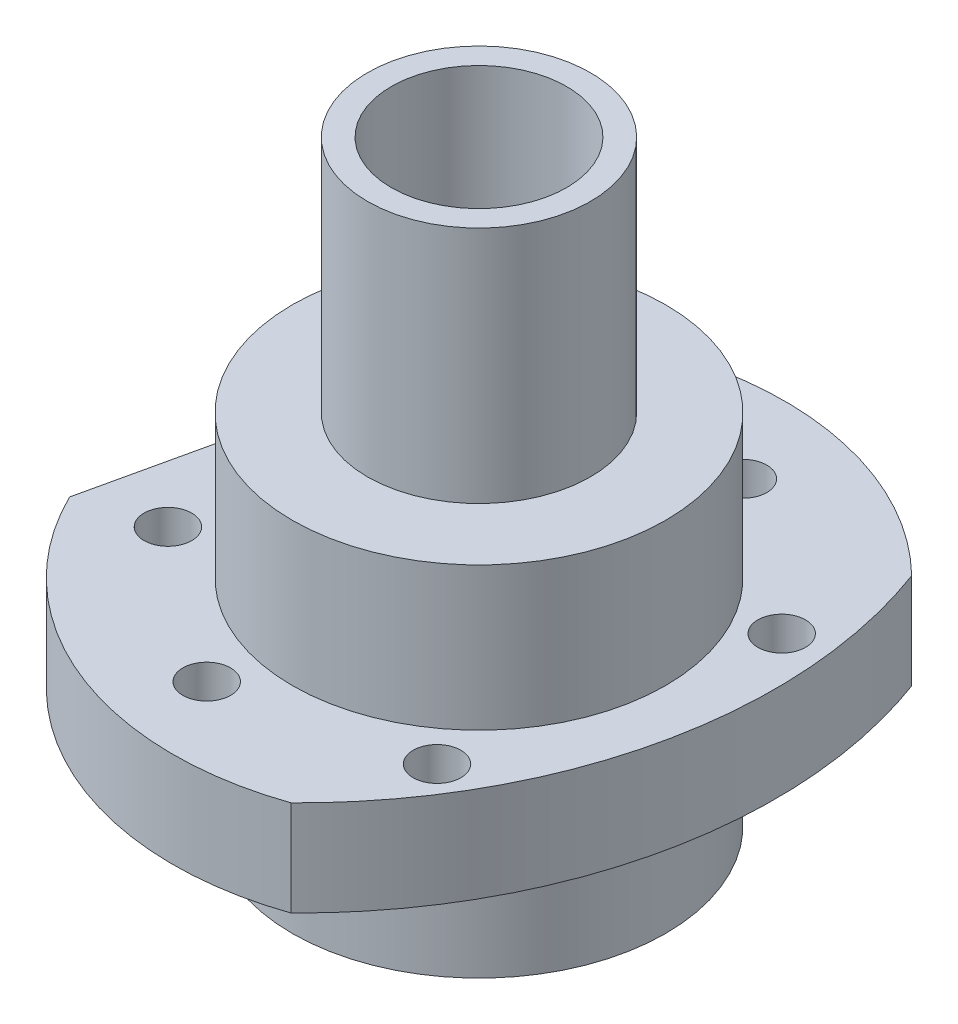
ISO-10303-21;
HEADER;
FILE_DESCRIPTION(('STEP AP214'),'2;1');
FILE_NAME('part.step','',(''),(''),'','','');
FILE_SCHEMA(('AUTOMOTIVE_DESIGN { 1 0 10303 214 1 1 1 1 }'));
ENDSEC;
DATA;
#1=APPLICATION_CONTEXT('core data for automotive mechanical design processes');
#2=APPLICATION_PROTOCOL_DEFINITION('international standard','automotive_design',2000,#1);
#3=PRODUCT_CONTEXT('',#1,'mechanical');
#4=PRODUCT('Part','Part','',(#3));
#5=PRODUCT_RELATED_PRODUCT_CATEGORY('part','',(#4));
#6=PRODUCT_DEFINITION_FORMATION('','',#4);
#7=PRODUCT_DEFINITION_CONTEXT('part definition',#1,'design');
#8=PRODUCT_DEFINITION('design','',#6,#7);
#9=PRODUCT_DEFINITION_SHAPE('','',#8);
#10=(LENGTH_UNIT() NAMED_UNIT(*) SI_UNIT(.MILLI.,.METRE.));
#11=(NAMED_UNIT(*) PLANE_ANGLE_UNIT() SI_UNIT($,.RADIAN.));
#12=(NAMED_UNIT(*) SI_UNIT($,.STERADIAN.) SOLID_ANGLE_UNIT());
#13=UNCERTAINTY_MEASURE_WITH_UNIT(LENGTH_MEASURE(1.E-05),#10,'distance_accuracy_value','');
#14=(GEOMETRIC_REPRESENTATION_CONTEXT(3) GLOBAL_UNCERTAINTY_ASSIGNED_CONTEXT((#13)) GLOBAL_UNIT_ASSIGNED_CONTEXT((#10,
#11,#12)) REPRESENTATION_CONTEXT('',''));
#15=CARTESIAN_POINT('',(0.,0.,0.));
#16=DIRECTION('',(0.,0.,1.));
#17=DIRECTION('',(1.,0.,0.));
#18=AXIS2_PLACEMENT_3D('',#15,#16,#17);
#19=CARTESIAN_POINT('',(0.,30.,-0.349999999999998));
#20=DIRECTION('',(0.,1.,0.));
#21=DIRECTION('',(0.,0.,1.));
#22=AXIS2_PLACEMENT_3D('',#19,#20,#21);
#23=CYLINDRICAL_SURFACE('',#22,25.65);
#24=CARTESIAN_POINT('',(0.,10.,-0.35));
#25=DIRECTION('',(0.,1.,0.));
#26=DIRECTION('',(0.,0.,1.));
#27=AXIS2_PLACEMENT_3D('',#24,#25,#26);
#28=CIRCLE('',#27,25.65);
#29=CARTESIAN_POINT('',(17.9879425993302,10.,-18.6354155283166));
#30=VERTEX_POINT('',#29);
#31=CARTESIAN_POINT('',(-16.0021113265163,10.,-20.3963196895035));
#32=VERTEX_POINT('',#31);
#33=EDGE_CURVE('E54',#30,#32,#28,.T.);
#34=ORIENTED_EDGE('',*,*,#33,.T.);
#35=DIRECTION('',(0.,1.,0.));
#36=VECTOR('',#35,1.);
#37=CARTESIAN_POINT('',(-16.0021113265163,10.,-20.3963196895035));
#38=LINE('',#37,#36);
#39=CARTESIAN_POINT('',(-16.0021113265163,18.,-20.3963196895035));
#40=VERTEX_POINT('',#39);
#41=EDGE_CURVE('E89',#32,#40,#38,.T.);
#42=ORIENTED_EDGE('',*,*,#41,.T.);
#43=CARTESIAN_POINT('',(0.,18.,-0.349999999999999));
#44=DIRECTION('',(0.,1.,0.));
#45=DIRECTION('',(0.,0.,1.));
#46=AXIS2_PLACEMENT_3D('',#43,#44,#45);
#47=CIRCLE('',#46,25.65);
#48=CARTESIAN_POINT('',(17.9879425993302,18.,-18.6354155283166));
#49=VERTEX_POINT('',#48);
#50=EDGE_CURVE('E112',#49,#40,#47,.T.);
#51=ORIENTED_EDGE('',*,*,#50,.F.);
#52=DIRECTION('',(0.,1.,0.));
#53=VECTOR('',#52,1.);
#54=CARTESIAN_POINT('',(17.9879425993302,10.,-18.6354155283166));
#55=LINE('',#54,#53);
#56=EDGE_CURVE('E70',#30,#49,#55,.T.);
#57=ORIENTED_EDGE('',*,*,#56,.F.);
#58=EDGE_LOOP('',(#34,#42,#51,#57));
#59=FACE_BOUND('',#58,.T.);
#60=ADVANCED_FACE('F43',(#59),#23,.T.);
#61=CARTESIAN_POINT('',(0.,30.,-0.349999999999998));
#62=DIRECTION('',(0.,1.,0.));
#63=DIRECTION('',(0.,0.,1.));
#64=AXIS2_PLACEMENT_3D('',#61,#62,#63);
#65=CYLINDRICAL_SURFACE('',#64,15.65);
#66=CARTESIAN_POINT('',(0.,10.,-0.35));
#67=DIRECTION('',(0.,1.,0.));
#68=DIRECTION('',(0.,0.,1.));
#69=AXIS2_PLACEMENT_3D('',#66,#67,#68);
#70=CIRCLE('',#69,15.65);
#71=CARTESIAN_POINT('',(0.,10.,15.3));
#72=VERTEX_POINT('',#71);
#73=EDGE_CURVE('E11',#72,#72,#70,.T.);
#74=ORIENTED_EDGE('',*,*,#73,.F.);
#75=EDGE_LOOP('',(#74));
#76=FACE_BOUND('',#75,.T.);
#77=CARTESIAN_POINT('',(0.,0.,-0.350000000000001));
#78=DIRECTION('',(0.,1.,0.));
#79=DIRECTION('',(0.,0.,1.));
#80=AXIS2_PLACEMENT_3D('',#77,#78,#79);
#81=CIRCLE('',#80,15.65);
#82=CARTESIAN_POINT('',(0.,0.,15.3));
#83=VERTEX_POINT('',#82);
#84=EDGE_CURVE('E192',#83,#83,#81,.T.);
#85=ORIENTED_EDGE('',*,*,#84,.T.);
#86=EDGE_LOOP('',(#85));
#87=FACE_BOUND('',#86,.T.);
#88=ADVANCED_FACE('F45',(#76,#87),#65,.T.);
#89=CARTESIAN_POINT('',(0.,10.,-16.));
#90=DIRECTION('',(0.,1.,0.));
#91=DIRECTION('',(0.,0.,1.));
#92=AXIS2_PLACEMENT_3D('',#89,#90,#91);
#93=PLANE('',#92);
#94=CARTESIAN_POINT('',(3.87484540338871,10.,-18.6006874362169));
#95=DIRECTION('',(0.,1.,0.));
#96=DIRECTION('',(0.,0.,1.));
#97=AXIS2_PLACEMENT_3D('',#94,#95,#96);
#98=CIRCLE('',#97,2.);
#99=CARTESIAN_POINT('',(3.87484540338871,10.,-16.6006874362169));
#100=VERTEX_POINT('',#99);
#101=EDGE_CURVE('E282',#100,#100,#98,.T.);
#102=ORIENTED_EDGE('',*,*,#101,.T.);
#103=EDGE_LOOP('',(#102));
#104=FACE_BOUND('',#103,.T.);
#105=CARTESIAN_POINT('',(16.7396558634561,10.,-8.98798762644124));
#106=DIRECTION('',(0.,1.,0.));
#107=DIRECTION('',(0.,0.,1.));
#108=AXIS2_PLACEMENT_3D('',#105,#106,#107);
#109=CIRCLE('',#108,1.99999999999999);
#110=CARTESIAN_POINT('',(16.7396558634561,10.,-6.98798762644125));
#111=VERTEX_POINT('',#110);
#112=EDGE_CURVE('E289',#111,#111,#109,.T.);
#113=ORIENTED_EDGE('',*,*,#112,.T.);
#114=EDGE_LOOP('',(#113));
#115=FACE_BOUND('',#114,.T.);
#116=CARTESIAN_POINT('',(11.7582506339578,9.99999999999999,14.9245952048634));
#117=DIRECTION('',(0.,1.,0.));
#118=DIRECTION('',(0.,0.,1.));
#119=AXIS2_PLACEMENT_3D('',#116,#117,#118);
#120=CIRCLE('',#119,2.);
#121=CARTESIAN_POINT('',(11.7582506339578,9.99999999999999,16.9245952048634));
#122=VERTEX_POINT('',#121);
#123=EDGE_CURVE('E297',#122,#122,#120,.T.);
#124=ORIENTED_EDGE('',*,*,#123,.T.);
#125=EDGE_LOOP('',(#124));
#126=FACE_BOUND('',#125,.T.);
#127=CARTESIAN_POINT('',(-3.87484540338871,9.99999999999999,18.6006874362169));
#128=DIRECTION('',(0.,1.,0.));
#129=DIRECTION('',(0.,0.,1.));
#130=AXIS2_PLACEMENT_3D('',#127,#128,#129);
#131=CIRCLE('',#130,2.);
#132=CARTESIAN_POINT('',(-3.87484540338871,9.99999999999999,20.6006874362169));
#133=VERTEX_POINT('',#132);
#134=EDGE_CURVE('E305',#133,#133,#131,.T.);
#135=ORIENTED_EDGE('',*,*,#134,.T.);
#136=EDGE_LOOP('',(#135));
#137=FACE_BOUND('',#136,.T.);
#138=CARTESIAN_POINT('',(-16.7396558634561,10.,8.98798762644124));
#139=DIRECTION('',(0.,1.,0.));
#140=DIRECTION('',(0.,0.,1.));
#141=AXIS2_PLACEMENT_3D('',#138,#139,#140);
#142=CIRCLE('',#141,2.);
#143=CARTESIAN_POINT('',(-16.7396558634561,10.,10.9879876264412));
#144=VERTEX_POINT('',#143);
#145=EDGE_CURVE('E313',#144,#144,#142,.T.);
#146=ORIENTED_EDGE('',*,*,#145,.T.);
#147=EDGE_LOOP('',(#146));
#148=FACE_BOUND('',#147,.T.);
#149=CARTESIAN_POINT('',(-11.7582506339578,10.,-14.9245952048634));
#150=DIRECTION('',(0.,1.,0.));
#151=DIRECTION('',(0.,0.,1.));
#152=AXIS2_PLACEMENT_3D('',#149,#150,#151);
#153=CIRCLE('',#152,2.);
#154=CARTESIAN_POINT('',(-11.7582506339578,10.,-12.9245952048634));
#155=VERTEX_POINT('',#154);
#156=EDGE_CURVE('E158',#155,#155,#153,.T.);
#157=ORIENTED_EDGE('',*,*,#156,.T.);
#158=EDGE_LOOP('',(#157));
#159=FACE_BOUND('',#158,.T.);
#160=CARTESIAN_POINT('',(-23.0289559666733,10.,10.9455605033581));
#161=VERTEX_POINT('',#160);
#162=CARTESIAN_POINT('',(8.45937832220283,9.99999999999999,23.864900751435));
#163=VERTEX_POINT('',#162);
#164=EDGE_CURVE('E102',#161,#163,#28,.T.);
#165=ORIENTED_EDGE('',*,*,#164,.F.);
#166=DIRECTION('',(0.218768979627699,0.,-0.975776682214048));
#167=VECTOR('',#166,1.);
#168=CARTESIAN_POINT('',(-16.0021113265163,10.,-20.3963196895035));
#169=LINE('',#168,#167);
#170=EDGE_CURVE('E86',#161,#32,#169,.T.);
#171=ORIENTED_EDGE('',*,*,#170,.T.);
#172=ORIENTED_EDGE('',*,*,#33,.F.);
#173=CARTESIAN_POINT('',(8.45937832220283,9.99999999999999,23.864900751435));
#174=CARTESIAN_POINT('',(9.26800201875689,9.99999999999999,23.0736709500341));
#175=CARTESIAN_POINT('',(10.9398108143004,9.99999999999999,21.2929400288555));
#176=CARTESIAN_POINT('',(13.2482889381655,9.99999999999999,18.3328210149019));
#177=CARTESIAN_POINT('',(15.3506210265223,9.99999999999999,15.0103732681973));
#178=CARTESIAN_POINT('',(17.1171730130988,10.,11.4978594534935));
#179=CARTESIAN_POINT('',(18.5309320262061,10.,7.8291069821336));
#180=CARTESIAN_POINT('',(19.5782827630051,10.,4.03944792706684));
#181=CARTESIAN_POINT('',(20.2491386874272,10.,0.165378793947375));
#182=CARTESIAN_POINT('',(20.5370390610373,10.,-3.75579100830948));
#183=CARTESIAN_POINT('',(20.4392112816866,10.,-7.68629847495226));
#184=CARTESIAN_POINT('',(19.9565975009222,10.,-11.5882906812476));
#185=CARTESIAN_POINT('',(19.1328775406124,10.,-15.2506480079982));
#186=CARTESIAN_POINT('',(18.3813579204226,10.,-17.5746887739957));
#187=CARTESIAN_POINT('',(17.9879425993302,10.,-18.6354155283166));
#188=B_SPLINE_CURVE_WITH_KNOTS('',3,(#173,#174,#175,#176,#177,#178,#179,#180,#181,#182,#183,
#184,#185,#186,#187),.UNSPECIFIED.,.F.,.F.,(4,1,1,1,1,1,1,1,1,1,1,1,4),(0.316752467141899,
0.343759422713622,0.375007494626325,0.406255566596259,0.43750363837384,0.468751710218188,
0.499999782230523,0.531247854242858,0.562495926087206,0.593743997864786,0.624992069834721,
0.656240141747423,0.68324709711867),.UNSPECIFIED.);
#189=EDGE_CURVE('E110',#30,#163,#188,.F.);
#190=ORIENTED_EDGE('',*,*,#189,.T.);
#191=EDGE_LOOP('',(#165,#171,#172,#190));
#192=FACE_BOUND('',#191,.T.);
#193=ORIENTED_EDGE('',*,*,#73,.T.);
#194=EDGE_LOOP('',(#193));
#195=FACE_BOUND('',#194,.T.);
#196=ADVANCED_FACE('F108',(#104,#115,#126,#137,#148,#159,#192,#195),#93,.F.);
#197=CARTESIAN_POINT('',(-23.0289559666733,18.,10.9455605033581));
#198=VERTEX_POINT('',#197);
#199=CARTESIAN_POINT('',(8.45937832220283,18.,23.864900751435));
#200=VERTEX_POINT('',#199);
#201=EDGE_CURVE('E104',#198,#200,#47,.T.);
#202=ORIENTED_EDGE('',*,*,#201,.F.);
#203=DIRECTION('',(0.,1.,0.));
#204=VECTOR('',#203,1.);
#205=CARTESIAN_POINT('',(-23.0289559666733,10.,10.9455605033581));
#206=LINE('',#205,#204);
#207=EDGE_CURVE('E62',#161,#198,#206,.T.);
#208=ORIENTED_EDGE('',*,*,#207,.F.);
#209=ORIENTED_EDGE('',*,*,#164,.T.);
#210=DIRECTION('',(0.,1.,0.));
#211=VECTOR('',#210,1.);
#212=CARTESIAN_POINT('',(8.45937832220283,9.99999999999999,23.864900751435));
#213=LINE('',#212,#211);
#214=EDGE_CURVE('E157',#163,#200,#213,.T.);
#215=ORIENTED_EDGE('',*,*,#214,.T.);
#216=EDGE_LOOP('',(#202,#208,#209,#215));
#217=FACE_BOUND('',#216,.T.);
#218=ADVANCED_FACE('F100',(#217),#23,.T.);
#219=CARTESIAN_POINT('',(0.,18.,-26.));
#220=DIRECTION('',(0.,-1.,0.));
#221=DIRECTION('',(0.,0.,-1.));
#222=AXIS2_PLACEMENT_3D('',#219,#220,#221);
#223=PLANE('',#222);
#224=CARTESIAN_POINT('',(3.87484540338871,18.,-18.6006874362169));
#225=DIRECTION('',(0.,1.,0.));
#226=DIRECTION('',(0.,0.,1.));
#227=AXIS2_PLACEMENT_3D('',#224,#225,#226);
#228=CIRCLE('',#227,2.);
#229=CARTESIAN_POINT('',(3.87484540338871,18.,-16.6006874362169));
#230=VERTEX_POINT('',#229);
#231=EDGE_CURVE('E285',#230,#230,#228,.T.);
#232=ORIENTED_EDGE('',*,*,#231,.F.);
#233=EDGE_LOOP('',(#232));
#234=FACE_BOUND('',#233,.T.);
#235=CARTESIAN_POINT('',(16.7396558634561,18.,-8.98798762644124));
#236=DIRECTION('',(0.,1.,0.));
#237=DIRECTION('',(0.,0.,1.));
#238=AXIS2_PLACEMENT_3D('',#235,#236,#237);
#239=CIRCLE('',#238,1.99999999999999);
#240=CARTESIAN_POINT('',(16.7396558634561,18.,-6.98798762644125));
#241=VERTEX_POINT('',#240);
#242=EDGE_CURVE('E293',#241,#241,#239,.T.);
#243=ORIENTED_EDGE('',*,*,#242,.F.);
#244=EDGE_LOOP('',(#243));
#245=FACE_BOUND('',#244,.T.);
#246=CARTESIAN_POINT('',(11.7582506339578,18.,14.9245952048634));
#247=DIRECTION('',(0.,1.,0.));
#248=DIRECTION('',(0.,0.,1.));
#249=AXIS2_PLACEMENT_3D('',#246,#247,#248);
#250=CIRCLE('',#249,2.);
#251=CARTESIAN_POINT('',(11.7582506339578,18.,16.9245952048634));
#252=VERTEX_POINT('',#251);
#253=EDGE_CURVE('E301',#252,#252,#250,.T.);
#254=ORIENTED_EDGE('',*,*,#253,.F.);
#255=EDGE_LOOP('',(#254));
#256=FACE_BOUND('',#255,.T.);
#257=CARTESIAN_POINT('',(-3.87484540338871,18.,18.6006874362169));
#258=DIRECTION('',(0.,1.,0.));
#259=DIRECTION('',(0.,0.,1.));
#260=AXIS2_PLACEMENT_3D('',#257,#258,#259);
#261=CIRCLE('',#260,2.);
#262=CARTESIAN_POINT('',(-3.87484540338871,18.,20.6006874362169));
#263=VERTEX_POINT('',#262);
#264=EDGE_CURVE('E309',#263,#263,#261,.T.);
#265=ORIENTED_EDGE('',*,*,#264,.F.);
#266=EDGE_LOOP('',(#265));
#267=FACE_BOUND('',#266,.T.);
#268=CARTESIAN_POINT('',(-16.7396558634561,18.,8.98798762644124));
#269=DIRECTION('',(0.,1.,0.));
#270=DIRECTION('',(0.,0.,1.));
#271=AXIS2_PLACEMENT_3D('',#268,#269,#270);
#272=CIRCLE('',#271,2.);
#273=CARTESIAN_POINT('',(-16.7396558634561,18.,10.9879876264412));
#274=VERTEX_POINT('',#273);
#275=EDGE_CURVE('E280',#274,#274,#272,.T.);
#276=ORIENTED_EDGE('',*,*,#275,.F.);
#277=EDGE_LOOP('',(#276));
#278=FACE_BOUND('',#277,.T.);
#279=CARTESIAN_POINT('',(-11.7582506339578,18.,-14.9245952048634));
#280=DIRECTION('',(0.,1.,0.));
#281=DIRECTION('',(0.,0.,1.));
#282=AXIS2_PLACEMENT_3D('',#279,#280,#281);
#283=CIRCLE('',#282,2.);
#284=CARTESIAN_POINT('',(-11.7582506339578,18.,-12.9245952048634));
#285=VERTEX_POINT('',#284);
#286=EDGE_CURVE('E164',#285,#285,#283,.T.);
#287=ORIENTED_EDGE('',*,*,#286,.F.);
#288=EDGE_LOOP('',(#287));
#289=FACE_BOUND('',#288,.T.);
#290=CARTESIAN_POINT('',(0.,18.,-0.349999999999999));
#291=DIRECTION('',(0.,1.,0.));
#292=DIRECTION('',(0.,0.,1.));
#293=AXIS2_PLACEMENT_3D('',#290,#291,#292);
#294=CIRCLE('',#293,15.65);
#295=CARTESIAN_POINT('',(0.,18.,15.3));
#296=VERTEX_POINT('',#295);
#297=EDGE_CURVE('E251',#296,#296,#294,.T.);
#298=ORIENTED_EDGE('',*,*,#297,.F.);
#299=EDGE_LOOP('',(#298));
#300=FACE_BOUND('',#299,.T.);
#301=ORIENTED_EDGE('',*,*,#50,.T.);
#302=DIRECTION('',(0.218768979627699,0.,-0.975776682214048));
#303=VECTOR('',#302,1.);
#304=CARTESIAN_POINT('',(-16.0021113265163,18.,-20.3963196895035));
#305=LINE('',#304,#303);
#306=EDGE_CURVE('E95',#198,#40,#305,.T.);
#307=ORIENTED_EDGE('',*,*,#306,.F.);
#308=ORIENTED_EDGE('',*,*,#201,.T.);
#309=CARTESIAN_POINT('',(17.9879425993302,18.,-18.6354155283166));
#310=CARTESIAN_POINT('',(18.3813579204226,18.,-17.5746887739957));
#311=CARTESIAN_POINT('',(19.1328775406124,18.,-15.2506480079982));
#312=CARTESIAN_POINT('',(19.9565975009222,18.,-11.5882906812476));
#313=CARTESIAN_POINT('',(20.4392112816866,18.,-7.68629847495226));
#314=CARTESIAN_POINT('',(20.5370390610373,18.,-3.75579100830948));
#315=CARTESIAN_POINT('',(20.2491386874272,18.,0.165378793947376));
#316=CARTESIAN_POINT('',(19.5782827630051,18.,4.03944792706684));
#317=CARTESIAN_POINT('',(18.5309320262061,18.,7.8291069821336));
#318=CARTESIAN_POINT('',(17.1171730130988,18.,11.4978594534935));
#319=CARTESIAN_POINT('',(15.3506210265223,18.,15.0103732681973));
#320=CARTESIAN_POINT('',(13.2482889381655,18.,18.3328210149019));
#321=CARTESIAN_POINT('',(10.9398108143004,18.,21.2929400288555));
#322=CARTESIAN_POINT('',(9.26800201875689,18.,23.0736709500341));
#323=CARTESIAN_POINT('',(8.45937832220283,18.,23.864900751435));
#324=B_SPLINE_CURVE_WITH_KNOTS('',3,(#309,#310,#311,#312,#313,#314,#315,#316,#317,#318,#319,
#320,#321,#322,#323),.UNSPECIFIED.,.F.,.F.,(4,1,1,1,1,1,1,1,1,1,1,1,4),(0.316752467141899,
0.343759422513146,0.375007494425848,0.406255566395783,0.437503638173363,0.468751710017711,
0.499999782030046,0.531247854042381,0.562495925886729,0.593743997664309,0.624992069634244,
0.656240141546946,0.68324709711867),.UNSPECIFIED.);
#325=EDGE_CURVE('E259',#49,#200,#324,.T.);
#326=ORIENTED_EDGE('',*,*,#325,.F.);
#327=EDGE_LOOP('',(#301,#307,#308,#326));
#328=FACE_BOUND('',#327,.T.);
#329=ADVANCED_FACE('F128',(#234,#245,#256,#267,#278,#289,#300,#328),#223,.F.);
#330=CARTESIAN_POINT('',(0.,30.,-0.349999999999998));
#331=DIRECTION('',(0.,1.,0.));
#332=DIRECTION('',(0.,0.,1.));
#333=AXIS2_PLACEMENT_3D('',#330,#331,#332);
#334=CYLINDRICAL_SURFACE('',#333,15.65);
#335=CARTESIAN_POINT('',(0.,30.,-0.349999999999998));
#336=DIRECTION('',(0.,1.,0.));
#337=DIRECTION('',(0.,0.,1.));
#338=AXIS2_PLACEMENT_3D('',#335,#336,#337);
#339=CIRCLE('',#338,15.65);
#340=CARTESIAN_POINT('',(0.,30.,15.3));
#341=VERTEX_POINT('',#340);
#342=EDGE_CURVE('E247',#341,#341,#339,.T.);
#343=ORIENTED_EDGE('',*,*,#342,.F.);
#344=EDGE_LOOP('',(#343));
#345=FACE_BOUND('',#344,.T.);
#346=ORIENTED_EDGE('',*,*,#297,.T.);
#347=EDGE_LOOP('',(#346));
#348=FACE_BOUND('',#347,.T.);
#349=ADVANCED_FACE('F138',(#345,#348),#334,.T.);
#350=CARTESIAN_POINT('',(0.,30.,-16.));
#351=DIRECTION('',(0.,-1.,0.));
#352=DIRECTION('',(0.,0.,-1.));
#353=AXIS2_PLACEMENT_3D('',#350,#351,#352);
#354=PLANE('',#353);
#355=CARTESIAN_POINT('',(0.,30.,-0.349999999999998));
#356=DIRECTION('',(0.,1.,0.));
#357=DIRECTION('',(0.,0.,1.));
#358=AXIS2_PLACEMENT_3D('',#355,#356,#357);
#359=CIRCLE('',#358,9.35);
#360=CARTESIAN_POINT('',(0.,30.,9.));
#361=VERTEX_POINT('',#360);
#362=EDGE_CURVE('E243',#361,#361,#359,.T.);
#363=ORIENTED_EDGE('',*,*,#362,.F.);
#364=EDGE_LOOP('',(#363));
#365=FACE_BOUND('',#364,.T.);
#366=ORIENTED_EDGE('',*,*,#342,.T.);
#367=EDGE_LOOP('',(#366));
#368=FACE_BOUND('',#367,.T.);
#369=ADVANCED_FACE('F329',(#365,#368),#354,.F.);
#370=CARTESIAN_POINT('',(0.,30.,-0.349999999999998));
#371=DIRECTION('',(0.,1.,0.));
#372=DIRECTION('',(0.,0.,1.));
#373=AXIS2_PLACEMENT_3D('',#370,#371,#372);
#374=CYLINDRICAL_SURFACE('',#373,9.35);
#375=CARTESIAN_POINT('',(0.,50.,-0.349999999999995));
#376=DIRECTION('',(0.,1.,0.));
#377=DIRECTION('',(0.,0.,1.));
#378=AXIS2_PLACEMENT_3D('',#375,#376,#377);
#379=CIRCLE('',#378,9.35);
#380=CARTESIAN_POINT('',(0.,50.,9.00000000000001));
#381=VERTEX_POINT('',#380);
#382=EDGE_CURVE('E239',#381,#381,#379,.T.);
#383=ORIENTED_EDGE('',*,*,#382,.F.);
#384=EDGE_LOOP('',(#383));
#385=FACE_BOUND('',#384,.T.);
#386=ORIENTED_EDGE('',*,*,#362,.T.);
#387=EDGE_LOOP('',(#386));
#388=FACE_BOUND('',#387,.T.);
#389=ADVANCED_FACE('F334',(#385,#388),#374,.T.);
#390=CARTESIAN_POINT('',(0.,50.,-7.7));
#391=DIRECTION('',(0.,-1.,0.));
#392=DIRECTION('',(0.,0.,-1.));
#393=AXIS2_PLACEMENT_3D('',#390,#391,#392);
#394=PLANE('',#393);
#395=CARTESIAN_POINT('',(0.,50.,-0.349999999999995));
#396=DIRECTION('',(0.,1.,0.));
#397=DIRECTION('',(0.,0.,1.));
#398=AXIS2_PLACEMENT_3D('',#395,#396,#397);
#399=CIRCLE('',#398,7.35);
#400=CARTESIAN_POINT('',(0.,50.,7.00000000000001));
#401=VERTEX_POINT('',#400);
#402=EDGE_CURVE('E235',#401,#401,#399,.T.);
#403=ORIENTED_EDGE('',*,*,#402,.F.);
#404=EDGE_LOOP('',(#403));
#405=FACE_BOUND('',#404,.T.);
#406=ORIENTED_EDGE('',*,*,#382,.T.);
#407=EDGE_LOOP('',(#406));
#408=FACE_BOUND('',#407,.T.);
#409=ADVANCED_FACE('F341',(#405,#408),#394,.F.);
#410=CARTESIAN_POINT('',(0.,30.,-0.349999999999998));
#411=DIRECTION('',(0.,1.,0.));
#412=DIRECTION('',(0.,0.,1.));
#413=AXIS2_PLACEMENT_3D('',#410,#411,#412);
#414=CYLINDRICAL_SURFACE('',#413,7.35);
#415=CARTESIAN_POINT('',(0.,27.,-0.349999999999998));
#416=DIRECTION('',(0.,1.,0.));
#417=DIRECTION('',(0.,0.,1.));
#418=AXIS2_PLACEMENT_3D('',#415,#416,#417);
#419=CIRCLE('',#418,7.35);
#420=CARTESIAN_POINT('',(0.,27.,7.));
#421=VERTEX_POINT('',#420);
#422=EDGE_CURVE('E231',#421,#421,#419,.T.);
#423=ORIENTED_EDGE('',*,*,#422,.F.);
#424=EDGE_LOOP('',(#423));
#425=FACE_BOUND('',#424,.T.);
#426=ORIENTED_EDGE('',*,*,#402,.T.);
#427=EDGE_LOOP('',(#426));
#428=FACE_BOUND('',#427,.T.);
#429=ADVANCED_FACE('F348',(#425,#428),#414,.F.);
#430=CARTESIAN_POINT('',(0.,27.,-7.7));
#431=DIRECTION('',(0.,1.,0.));
#432=DIRECTION('',(0.,0.,1.));
#433=AXIS2_PLACEMENT_3D('',#430,#431,#432);
#434=PLANE('',#433);
#435=CARTESIAN_POINT('',(0.,27.,-0.349999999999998));
#436=DIRECTION('',(0.,1.,0.));
#437=DIRECTION('',(0.,0.,1.));
#438=AXIS2_PLACEMENT_3D('',#435,#436,#437);
#439=CIRCLE('',#438,12.65);
#440=CARTESIAN_POINT('',(0.,27.,12.3));
#441=VERTEX_POINT('',#440);
#442=EDGE_CURVE('E227',#441,#441,#439,.T.);
#443=ORIENTED_EDGE('',*,*,#442,.F.);
#444=EDGE_LOOP('',(#443));
#445=FACE_BOUND('',#444,.T.);
#446=ORIENTED_EDGE('',*,*,#422,.T.);
#447=EDGE_LOOP('',(#446));
#448=FACE_BOUND('',#447,.T.);
#449=ADVANCED_FACE('F352',(#445,#448),#434,.F.);
#450=CARTESIAN_POINT('',(0.,30.,-0.349999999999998));
#451=DIRECTION('',(0.,1.,0.));
#452=DIRECTION('',(0.,0.,1.));
#453=AXIS2_PLACEMENT_3D('',#450,#451,#452);
#454=CYLINDRICAL_SURFACE('',#453,12.65);
#455=CARTESIAN_POINT('',(0.,5.,-0.350000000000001));
#456=DIRECTION('',(0.,1.,0.));
#457=DIRECTION('',(0.,0.,1.));
#458=AXIS2_PLACEMENT_3D('',#455,#456,#457);
#459=CIRCLE('',#458,12.65);
#460=CARTESIAN_POINT('',(0.,5.,12.3));
#461=VERTEX_POINT('',#460);
#462=EDGE_CURVE('E223',#461,#461,#459,.T.);
#463=ORIENTED_EDGE('',*,*,#462,.F.);
#464=EDGE_LOOP('',(#463));
#465=FACE_BOUND('',#464,.T.);
#466=ORIENTED_EDGE('',*,*,#442,.T.);
#467=EDGE_LOOP('',(#466));
#468=FACE_BOUND('',#467,.T.);
#469=ADVANCED_FACE('F356',(#465,#468),#454,.F.);
#470=CARTESIAN_POINT('',(0.,5.,-13.3));
#471=DIRECTION('',(0.,1.,0.));
#472=DIRECTION('',(0.,0.,1.));
#473=AXIS2_PLACEMENT_3D('',#470,#471,#472);
#474=PLANE('',#473);
#475=CARTESIAN_POINT('',(0.,5.,-0.350000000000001));
#476=DIRECTION('',(0.,1.,0.));
#477=DIRECTION('',(0.,0.,1.));
#478=AXIS2_PLACEMENT_3D('',#475,#476,#477);
#479=CIRCLE('',#478,12.95);
#480=CARTESIAN_POINT('',(0.,5.,12.6));
#481=VERTEX_POINT('',#480);
#482=EDGE_CURVE('E219',#481,#481,#479,.T.);
#483=ORIENTED_EDGE('',*,*,#482,.F.);
#484=EDGE_LOOP('',(#483));
#485=FACE_BOUND('',#484,.T.);
#486=ORIENTED_EDGE('',*,*,#462,.T.);
#487=EDGE_LOOP('',(#486));
#488=FACE_BOUND('',#487,.T.);
#489=ADVANCED_FACE('F360',(#485,#488),#474,.F.);
#490=CARTESIAN_POINT('',(0.,4.3,-0.350000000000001));
#491=DIRECTION('',(0.,1.,0.));
#492=DIRECTION('',(0.,0.,1.));
#493=AXIS2_PLACEMENT_3D('',#490,#491,#492);
#494=TOROIDAL_SURFACE('',#493,12.95,0.699999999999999);
#495=CARTESIAN_POINT('',(0.,4.3,-0.350000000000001));
#496=DIRECTION('',(0.,1.,0.));
#497=DIRECTION('',(0.,0.,1.));
#498=AXIS2_PLACEMENT_3D('',#495,#496,#497);
#499=CIRCLE('',#498,13.65);
#500=CARTESIAN_POINT('',(0.,4.3,13.3));
#501=VERTEX_POINT('',#500);
#502=EDGE_CURVE('E215',#501,#501,#499,.T.);
#503=ORIENTED_EDGE('',*,*,#502,.F.);
#504=EDGE_LOOP('',(#503));
#505=FACE_BOUND('',#504,.T.);
#506=ORIENTED_EDGE('',*,*,#482,.T.);
#507=EDGE_LOOP('',(#506));
#508=FACE_BOUND('',#507,.T.);
#509=ADVANCED_FACE('F364',(#505,#508),#494,.F.);
#510=CARTESIAN_POINT('',(0.,30.,-0.349999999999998));
#511=DIRECTION('',(0.,1.,0.));
#512=DIRECTION('',(0.,0.,1.));
#513=AXIS2_PLACEMENT_3D('',#510,#511,#512);
#514=CYLINDRICAL_SURFACE('',#513,13.65);
#515=CARTESIAN_POINT('',(0.,2.7,-0.350000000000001));
#516=DIRECTION('',(0.,1.,0.));
#517=DIRECTION('',(0.,0.,1.));
#518=AXIS2_PLACEMENT_3D('',#515,#516,#517);
#519=CIRCLE('',#518,13.65);
#520=CARTESIAN_POINT('',(0.,2.7,13.3));
#521=VERTEX_POINT('',#520);
#522=EDGE_CURVE('E211',#521,#521,#519,.T.);
#523=ORIENTED_EDGE('',*,*,#522,.F.);
#524=EDGE_LOOP('',(#523));
#525=FACE_BOUND('',#524,.T.);
#526=ORIENTED_EDGE('',*,*,#502,.T.);
#527=EDGE_LOOP('',(#526));
#528=FACE_BOUND('',#527,.T.);
#529=ADVANCED_FACE('F368',(#525,#528),#514,.F.);
#530=CARTESIAN_POINT('',(0.,2.7,-0.350000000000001));
#531=DIRECTION('',(0.,1.,0.));
#532=DIRECTION('',(0.,0.,1.));
#533=AXIS2_PLACEMENT_3D('',#530,#531,#532);
#534=TOROIDAL_SURFACE('',#533,12.95,0.699999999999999);
#535=CARTESIAN_POINT('',(0.,2.,-0.350000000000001));
#536=DIRECTION('',(0.,1.,0.));
#537=DIRECTION('',(0.,0.,1.));
#538=AXIS2_PLACEMENT_3D('',#535,#536,#537);
#539=CIRCLE('',#538,12.95);
#540=CARTESIAN_POINT('',(0.,2.,12.6));
#541=VERTEX_POINT('',#540);
#542=EDGE_CURVE('E207',#541,#541,#539,.T.);
#543=ORIENTED_EDGE('',*,*,#542,.F.);
#544=EDGE_LOOP('',(#543));
#545=FACE_BOUND('',#544,.T.);
#546=ORIENTED_EDGE('',*,*,#522,.T.);
#547=EDGE_LOOP('',(#546));
#548=FACE_BOUND('',#547,.T.);
#549=ADVANCED_FACE('F372',(#545,#548),#534,.F.);
#550=CARTESIAN_POINT('',(0.,2.,-13.));
#551=DIRECTION('',(0.,-1.,0.));
#552=DIRECTION('',(0.,0.,-1.));
#553=AXIS2_PLACEMENT_3D('',#550,#551,#552);
#554=PLANE('',#553);
#555=CARTESIAN_POINT('',(0.,2.,-0.350000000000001));
#556=DIRECTION('',(0.,1.,0.));
#557=DIRECTION('',(0.,0.,1.));
#558=AXIS2_PLACEMENT_3D('',#555,#556,#557);
#559=CIRCLE('',#558,12.65);
#560=CARTESIAN_POINT('',(0.,2.,12.3));
#561=VERTEX_POINT('',#560);
#562=EDGE_CURVE('E203',#561,#561,#559,.T.);
#563=ORIENTED_EDGE('',*,*,#562,.F.);
#564=EDGE_LOOP('',(#563));
#565=FACE_BOUND('',#564,.T.);
#566=ORIENTED_EDGE('',*,*,#542,.T.);
#567=EDGE_LOOP('',(#566));
#568=FACE_BOUND('',#567,.T.);
#569=ADVANCED_FACE('F376',(#565,#568),#554,.F.);
#570=CARTESIAN_POINT('',(0.,30.,-0.349999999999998));
#571=DIRECTION('',(0.,1.,0.));
#572=DIRECTION('',(0.,0.,1.));
#573=AXIS2_PLACEMENT_3D('',#570,#571,#572);
#574=CYLINDRICAL_SURFACE('',#573,12.65);
#575=CARTESIAN_POINT('',(0.,0.,-0.350000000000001));
#576=DIRECTION('',(0.,1.,0.));
#577=DIRECTION('',(0.,0.,1.));
#578=AXIS2_PLACEMENT_3D('',#575,#576,#577);
#579=CIRCLE('',#578,12.65);
#580=CARTESIAN_POINT('',(0.,0.,12.3));
#581=VERTEX_POINT('',#580);
#582=EDGE_CURVE('E199',#581,#581,#579,.T.);
#583=ORIENTED_EDGE('',*,*,#582,.F.);
#584=EDGE_LOOP('',(#583));
#585=FACE_BOUND('',#584,.T.);
#586=ORIENTED_EDGE('',*,*,#562,.T.);
#587=EDGE_LOOP('',(#586));
#588=FACE_BOUND('',#587,.T.);
#589=ADVANCED_FACE('F379',(#585,#588),#574,.F.);
#590=CARTESIAN_POINT('',(0.,0.,-13.));
#591=DIRECTION('',(0.,1.,0.));
#592=DIRECTION('',(0.,0.,1.));
#593=AXIS2_PLACEMENT_3D('',#590,#591,#592);
#594=PLANE('',#593);
#595=ORIENTED_EDGE('',*,*,#84,.F.);
#596=EDGE_LOOP('',(#595));
#597=FACE_BOUND('',#596,.T.);
#598=ORIENTED_EDGE('',*,*,#582,.T.);
#599=EDGE_LOOP('',(#598));
#600=FACE_BOUND('',#599,.T.);
#601=ADVANCED_FACE('F184',(#597,#600),#594,.F.);
#602=CARTESIAN_POINT('',(-10.7647744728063,10.,-43.7564468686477));
#603=CARTESIAN_POINT('',(-10.4458622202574,10.,-43.6825744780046));
#604=CARTESIAN_POINT('',(-9.80822993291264,10.,-43.5348742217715));
#605=CARTESIAN_POINT('',(-8.85913680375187,10.,-43.2836751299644));
#606=CARTESIAN_POINT('',(-7.91608627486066,10.,-43.0109060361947));
#607=CARTESIAN_POINT('',(-6.66808760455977,10.,-42.6158565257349));
#608=CARTESIAN_POINT('',(-5.12662314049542,10.,-42.0650469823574));
#609=CARTESIAN_POINT('',(-3.31185090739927,10.,-41.3139550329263));
#610=CARTESIAN_POINT('',(-1.53597947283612,10.,-40.4748577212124));
#611=CARTESIAN_POINT('',(0.773456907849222,10.,-39.2413826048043));
#612=CARTESIAN_POINT('',(3.54278131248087,10.,-37.4891575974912));
#613=CARTESIAN_POINT('',(6.64302097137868,10.,-35.0713484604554));
#614=CARTESIAN_POINT('',(9.49152297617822,10.,-32.3612194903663));
#615=CARTESIAN_POINT('',(12.0606220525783,10.,-29.384961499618));
#616=CARTESIAN_POINT('',(14.3256386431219,10.,-26.1712131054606));
#617=CARTESIAN_POINT('',(16.2647426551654,10.,-22.7509309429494));
#618=CARTESIAN_POINT('',(17.8592640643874,10.,-19.1570525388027));
#619=CARTESIAN_POINT('',(19.0938454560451,10.,-15.4241893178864));
#620=CARTESIAN_POINT('',(19.9565975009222,10.,-11.5882906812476));
#621=CARTESIAN_POINT('',(20.4392112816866,10.,-7.68629847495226));
#622=CARTESIAN_POINT('',(20.5370390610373,10.,-3.75579100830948));
#623=CARTESIAN_POINT('',(20.2491386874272,10.,0.165378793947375));
#624=CARTESIAN_POINT('',(19.5782827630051,10.,4.03944792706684));
#625=CARTESIAN_POINT('',(18.5309320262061,10.,7.8291069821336));
#626=CARTESIAN_POINT('',(17.1171730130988,10.,11.4978594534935));
#627=CARTESIAN_POINT('',(15.3506210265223,9.99999999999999,15.0103732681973));
#628=CARTESIAN_POINT('',(13.2482889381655,9.99999999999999,18.3328210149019));
#629=CARTESIAN_POINT('',(10.8304232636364,9.99999999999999,21.4332056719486));
#630=CARTESIAN_POINT('',(8.12030952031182,9.99999999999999,24.2816688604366));
#631=CARTESIAN_POINT('',(5.14404720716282,9.99999999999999,26.8507782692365));
#632=CARTESIAN_POINT('',(1.93030071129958,9.99999999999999,29.1157921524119));
#633=CARTESIAN_POINT('',(-1.48998471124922,9.99999999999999,31.0548967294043));
#634=CARTESIAN_POINT('',(-5.08385191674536,9.99999999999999,32.6494186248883));
#635=CARTESIAN_POINT('',(-8.81675677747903,9.99999999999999,33.8839972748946));
#636=CARTESIAN_POINT('',(-12.6525000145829,9.99999999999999,34.7467598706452));
#637=CARTESIAN_POINT('',(-15.9048396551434,9.99999999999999,35.1489295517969));
#638=CARTESIAN_POINT('',(-18.5198355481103,9.99999999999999,35.2783460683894));
#639=CARTESIAN_POINT('',(-20.4839674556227,9.99999999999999,35.2789402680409));
#640=CARTESIAN_POINT('',(-22.4456905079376,9.99999999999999,35.1833235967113));
#641=CARTESIAN_POINT('',(-23.9661953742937,9.99999999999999,35.0340145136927));
#642=CARTESIAN_POINT('',(-25.047782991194,9.99999999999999,34.892014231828));
#643=CARTESIAN_POINT('',(-25.6952542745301,9.99999999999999,34.7961970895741));
#644=CARTESIAN_POINT('',(-26.3409054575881,9.99999999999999,34.6898742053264));
#645=CARTESIAN_POINT('',(-26.9846842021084,9.99999999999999,34.5727916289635));
#646=CARTESIAN_POINT('',(-27.626801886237,9.99999999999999,34.4458984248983));
#647=CARTESIAN_POINT('',(-28.053091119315,9.99999999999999,34.3524329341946));
#648=CARTESIAN_POINT('',(-28.2662928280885,9.99999999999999,34.3056876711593));
#649=B_SPLINE_CURVE_WITH_KNOTS('',3,(#602,#603,#604,#605,#606,#607,#608,#609,#610,#611,#612,
#613,#614,#615,#616,#617,#618,#619,#620,#621,#622,#623,#624,#625,#626,#627,#628,#629,#630,#631,
#632,#633,#634,#635,#636,#637,#638,#639,#640,#641,#642,#643,#644,#645,#646,#647,#648),
.UNSPECIFIED.,.F.,.F.,(4,1,1,1,1,1,1,1,1,1,1,1,1,1,1,1,1,1,1,1,1,1,1,1,1,1,1,1,1,1,1,1,1,1,1,1,
1,1,1,1,1,1,1,1,4),(0.,0.00781731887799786,0.0156299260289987,0.0234425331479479,
0.0312598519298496,0.046888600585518,0.0625173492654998,0.0781460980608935,0.0937748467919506,
0.1250229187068,0.156270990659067,0.187519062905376,0.218767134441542,0.250015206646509,
0.281263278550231,0.312511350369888,0.343759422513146,0.375007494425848,0.406255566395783,
0.437503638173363,0.468751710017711,0.499999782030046,0.531247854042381,0.562495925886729,
0.593743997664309,0.624992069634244,0.656240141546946,0.687488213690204,0.718736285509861,
0.749984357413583,0.78123242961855,0.812480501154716,0.843728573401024,0.874976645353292,
0.906224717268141,0.921853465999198,0.937482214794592,0.953110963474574,0.968739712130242,
0.973952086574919,0.979161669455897,0.98436985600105,0.989578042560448,0.994787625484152,1.),.UNSPECIFIED.);
#650=DIRECTION('',(0.,1.,0.));
#651=VECTOR('',#650,1.);
#652=SURFACE_OF_LINEAR_EXTRUSION('',#649,#651);
#653=ORIENTED_EDGE('',*,*,#325,.T.);
#654=ORIENTED_EDGE('',*,*,#214,.F.);
#655=ORIENTED_EDGE('',*,*,#189,.F.);
#656=ORIENTED_EDGE('',*,*,#56,.T.);
#657=EDGE_LOOP('',(#653,#654,#655,#656));
#658=FACE_BOUND('',#657,.T.);
#659=ADVANCED_FACE('F174',(#658),#652,.F.);
#660=CARTESIAN_POINT('',(-16.0021113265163,10.,-20.3963196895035));
#661=DIRECTION('',(0.975776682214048,0.,0.218768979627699));
#662=DIRECTION('',(0.218768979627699,0.,-0.975776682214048));
#663=AXIS2_PLACEMENT_3D('',#660,#661,#662);
#664=PLANE('',#663);
#665=ORIENTED_EDGE('',*,*,#306,.T.);
#666=ORIENTED_EDGE('',*,*,#41,.F.);
#667=ORIENTED_EDGE('',*,*,#170,.F.);
#668=ORIENTED_EDGE('',*,*,#207,.T.);
#669=EDGE_LOOP('',(#665,#666,#667,#668));
#670=FACE_BOUND('',#669,.T.);
#671=ADVANCED_FACE('F87',(#670),#664,.F.);
#672=CARTESIAN_POINT('',(-11.7582506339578,10.,-14.9245952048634));
#673=DIRECTION('',(0.,1.,0.));
#674=DIRECTION('',(0.,0.,1.));
#675=AXIS2_PLACEMENT_3D('',#672,#673,#674);
#676=CYLINDRICAL_SURFACE('',#675,2.);
#677=ORIENTED_EDGE('',*,*,#156,.F.);
#678=EDGE_LOOP('',(#677));
#679=FACE_BOUND('',#678,.T.);
#680=ORIENTED_EDGE('',*,*,#286,.T.);
#681=EDGE_LOOP('',(#680));
#682=FACE_BOUND('',#681,.T.);
#683=ADVANCED_FACE('F425',(#679,#682),#676,.F.);
#684=CARTESIAN_POINT('',(-16.7396558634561,10.,8.98798762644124));
#685=DIRECTION('',(0.,1.,0.));
#686=DIRECTION('',(0.,0.,1.));
#687=AXIS2_PLACEMENT_3D('',#684,#685,#686);
#688=CYLINDRICAL_SURFACE('',#687,2.);
#689=ORIENTED_EDGE('',*,*,#145,.F.);
#690=EDGE_LOOP('',(#689));
#691=FACE_BOUND('',#690,.T.);
#692=ORIENTED_EDGE('',*,*,#275,.T.);
#693=EDGE_LOOP('',(#692));
#694=FACE_BOUND('',#693,.T.);
#695=ADVANCED_FACE('F321',(#691,#694),#688,.F.);
#696=CARTESIAN_POINT('',(-3.87484540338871,9.99999999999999,18.6006874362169));
#697=DIRECTION('',(0.,1.,0.));
#698=DIRECTION('',(0.,0.,1.));
#699=AXIS2_PLACEMENT_3D('',#696,#697,#698);
#700=CYLINDRICAL_SURFACE('',#699,2.);
#701=ORIENTED_EDGE('',*,*,#134,.F.);
#702=EDGE_LOOP('',(#701));
#703=FACE_BOUND('',#702,.T.);
#704=ORIENTED_EDGE('',*,*,#264,.T.);
#705=EDGE_LOOP('',(#704));
#706=FACE_BOUND('',#705,.T.);
#707=ADVANCED_FACE('F438',(#703,#706),#700,.F.);
#708=CARTESIAN_POINT('',(11.7582506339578,9.99999999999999,14.9245952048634));
#709=DIRECTION('',(0.,1.,0.));
#710=DIRECTION('',(0.,0.,1.));
#711=AXIS2_PLACEMENT_3D('',#708,#709,#710);
#712=CYLINDRICAL_SURFACE('',#711,2.);
#713=ORIENTED_EDGE('',*,*,#123,.F.);
#714=EDGE_LOOP('',(#713));
#715=FACE_BOUND('',#714,.T.);
#716=ORIENTED_EDGE('',*,*,#253,.T.);
#717=EDGE_LOOP('',(#716));
#718=FACE_BOUND('',#717,.T.);
#719=ADVANCED_FACE('F446',(#715,#718),#712,.F.);
#720=CARTESIAN_POINT('',(16.7396558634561,10.,-8.98798762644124));
#721=DIRECTION('',(0.,1.,0.));
#722=DIRECTION('',(0.,0.,1.));
#723=AXIS2_PLACEMENT_3D('',#720,#721,#722);
#724=CYLINDRICAL_SURFACE('',#723,1.99999999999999);
#725=ORIENTED_EDGE('',*,*,#112,.F.);
#726=EDGE_LOOP('',(#725));
#727=FACE_BOUND('',#726,.T.);
#728=ORIENTED_EDGE('',*,*,#242,.T.);
#729=EDGE_LOOP('',(#728));
#730=FACE_BOUND('',#729,.T.);
#731=ADVANCED_FACE('F454',(#727,#730),#724,.F.);
#732=CARTESIAN_POINT('',(3.87484540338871,10.,-18.6006874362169));
#733=DIRECTION('',(0.,1.,0.));
#734=DIRECTION('',(0.,0.,1.));
#735=AXIS2_PLACEMENT_3D('',#732,#733,#734);
#736=CYLINDRICAL_SURFACE('',#735,2.);
#737=ORIENTED_EDGE('',*,*,#101,.F.);
#738=EDGE_LOOP('',(#737));
#739=FACE_BOUND('',#738,.T.);
#740=ORIENTED_EDGE('',*,*,#231,.T.);
#741=EDGE_LOOP('',(#740));
#742=FACE_BOUND('',#741,.T.);
#743=ADVANCED_FACE('F462',(#739,#742),#736,.F.);
#744=CLOSED_SHELL('',(#60,#88,#196,#218,#329,#349,#369,#389,#409,#429,#449,#469,#489,#509,#529,
#549,#569,#589,#601,#659,#671,#683,#695,#707,#719,#731,#743));
#745=MANIFOLD_SOLID_BREP('B2',#744);
#746=ADVANCED_BREP_SHAPE_REPRESENTATION('',(#18,#745),#14);
#747=SHAPE_DEFINITION_REPRESENTATION(#9,#746);
ENDSEC;
END-ISO-10303-21;
